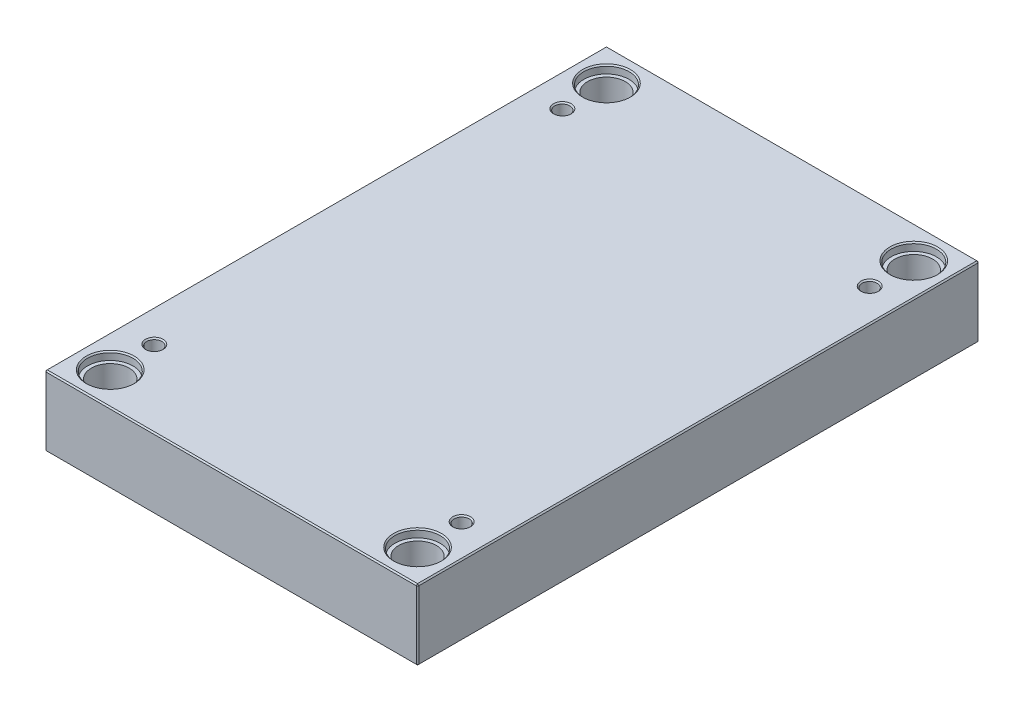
ISO-10303-21;
HEADER;
FILE_DESCRIPTION(('STEP AP214'),'2;1');
FILE_NAME('part.step','',(''),(''),'','','');
FILE_SCHEMA(('AUTOMOTIVE_DESIGN { 1 0 10303 214 1 1 1 1 }'));
ENDSEC;
DATA;
#1=APPLICATION_CONTEXT('core data for automotive mechanical design processes');
#2=APPLICATION_PROTOCOL_DEFINITION('international standard','automotive_design',2000,#1);
#3=PRODUCT_CONTEXT('',#1,'mechanical');
#4=PRODUCT('Part','Part','',(#3));
#5=PRODUCT_RELATED_PRODUCT_CATEGORY('part','',(#4));
#6=PRODUCT_DEFINITION_FORMATION('','',#4);
#7=PRODUCT_DEFINITION_CONTEXT('part definition',#1,'design');
#8=PRODUCT_DEFINITION('design','',#6,#7);
#9=PRODUCT_DEFINITION_SHAPE('','',#8);
#10=(LENGTH_UNIT() NAMED_UNIT(*) SI_UNIT(.MILLI.,.METRE.));
#11=(NAMED_UNIT(*) PLANE_ANGLE_UNIT() SI_UNIT($,.RADIAN.));
#12=(NAMED_UNIT(*) SI_UNIT($,.STERADIAN.) SOLID_ANGLE_UNIT());
#13=UNCERTAINTY_MEASURE_WITH_UNIT(LENGTH_MEASURE(1.E-05),#10,'distance_accuracy_value','');
#14=(GEOMETRIC_REPRESENTATION_CONTEXT(3) GLOBAL_UNCERTAINTY_ASSIGNED_CONTEXT((#13)) GLOBAL_UNIT_ASSIGNED_CONTEXT((#10,
#11,#12)) REPRESENTATION_CONTEXT('',''));
#15=CARTESIAN_POINT('',(0.,0.,0.));
#16=DIRECTION('',(0.,0.,1.));
#17=DIRECTION('',(1.,0.,0.));
#18=AXIS2_PLACEMENT_3D('',#15,#16,#17);
#19=CARTESIAN_POINT('',(-122.,0.,-197.));
#20=DIRECTION('',(0.,1.,0.));
#21=DIRECTION('',(0.,0.,1.));
#22=AXIS2_PLACEMENT_3D('',#19,#20,#21);
#23=CYLINDRICAL_SURFACE('',#22,15.);
#24=CARTESIAN_POINT('',(-122.,0.999999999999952,-197.));
#25=DIRECTION('',(0.,1.,0.));
#26=DIRECTION('',(0.,0.,1.));
#27=AXIS2_PLACEMENT_3D('',#24,#25,#26);
#28=CIRCLE('',#27,15.);
#29=CARTESIAN_POINT('',(-122.,0.999999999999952,-182.));
#30=VERTEX_POINT('',#29);
#31=EDGE_CURVE('E472',#30,#30,#28,.F.);
#32=ORIENTED_EDGE('',*,*,#31,.T.);
#33=EDGE_LOOP('',(#32));
#34=FACE_BOUND('',#33,.T.);
#35=CARTESIAN_POINT('',(-122.,49.7,-197.));
#36=DIRECTION('',(0.,1.,0.));
#37=DIRECTION('',(0.,0.,1.));
#38=AXIS2_PLACEMENT_3D('',#35,#36,#37);
#39=CIRCLE('',#38,15.);
#40=CARTESIAN_POINT('',(-122.,49.7,-182.));
#41=VERTEX_POINT('',#40);
#42=EDGE_CURVE('E221',#41,#41,#39,.F.);
#43=ORIENTED_EDGE('',*,*,#42,.F.);
#44=EDGE_LOOP('',(#43));
#45=FACE_BOUND('',#44,.T.);
#46=ADVANCED_FACE('F16',(#34,#45),#23,.F.);
#47=CARTESIAN_POINT('',(122.,0.,-197.));
#48=DIRECTION('',(0.,1.,0.));
#49=DIRECTION('',(0.,0.,1.));
#50=AXIS2_PLACEMENT_3D('',#47,#48,#49);
#51=CYLINDRICAL_SURFACE('',#50,15.);
#52=CARTESIAN_POINT('',(122.,0.999999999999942,-197.));
#53=DIRECTION('',(0.,1.,0.));
#54=DIRECTION('',(0.,0.,1.));
#55=AXIS2_PLACEMENT_3D('',#52,#53,#54);
#56=CIRCLE('',#55,15.);
#57=CARTESIAN_POINT('',(122.,0.999999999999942,-182.));
#58=VERTEX_POINT('',#57);
#59=EDGE_CURVE('E474',#58,#58,#56,.F.);
#60=ORIENTED_EDGE('',*,*,#59,.T.);
#61=EDGE_LOOP('',(#60));
#62=FACE_BOUND('',#61,.T.);
#63=CARTESIAN_POINT('',(122.,49.7,-197.));
#64=DIRECTION('',(0.,1.,0.));
#65=DIRECTION('',(0.,0.,1.));
#66=AXIS2_PLACEMENT_3D('',#63,#64,#65);
#67=CIRCLE('',#66,15.);
#68=CARTESIAN_POINT('',(122.,49.7,-182.));
#69=VERTEX_POINT('',#68);
#70=EDGE_CURVE('E218',#69,#69,#67,.F.);
#71=ORIENTED_EDGE('',*,*,#70,.F.);
#72=EDGE_LOOP('',(#71));
#73=FACE_BOUND('',#72,.T.);
#74=ADVANCED_FACE('F263',(#62,#73),#51,.F.);
#75=CARTESIAN_POINT('',(122.,0.,197.));
#76=DIRECTION('',(0.,1.,0.));
#77=DIRECTION('',(0.,0.,1.));
#78=AXIS2_PLACEMENT_3D('',#75,#76,#77);
#79=CYLINDRICAL_SURFACE('',#78,15.);
#80=CARTESIAN_POINT('',(122.,0.999999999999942,197.));
#81=DIRECTION('',(0.,1.,0.));
#82=DIRECTION('',(0.,0.,1.));
#83=AXIS2_PLACEMENT_3D('',#80,#81,#82);
#84=CIRCLE('',#83,15.);
#85=CARTESIAN_POINT('',(122.,0.999999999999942,212.));
#86=VERTEX_POINT('',#85);
#87=EDGE_CURVE('E477',#86,#86,#84,.F.);
#88=ORIENTED_EDGE('',*,*,#87,.T.);
#89=EDGE_LOOP('',(#88));
#90=FACE_BOUND('',#89,.T.);
#91=CARTESIAN_POINT('',(122.,49.7,197.));
#92=DIRECTION('',(0.,1.,0.));
#93=DIRECTION('',(0.,0.,1.));
#94=AXIS2_PLACEMENT_3D('',#91,#92,#93);
#95=CIRCLE('',#94,15.);
#96=CARTESIAN_POINT('',(122.,49.7,212.));
#97=VERTEX_POINT('',#96);
#98=EDGE_CURVE('E214',#97,#97,#95,.F.);
#99=ORIENTED_EDGE('',*,*,#98,.F.);
#100=EDGE_LOOP('',(#99));
#101=FACE_BOUND('',#100,.T.);
#102=ADVANCED_FACE('F270',(#90,#101),#79,.F.);
#103=CARTESIAN_POINT('',(-122.,0.,197.));
#104=DIRECTION('',(0.,1.,0.));
#105=DIRECTION('',(0.,0.,1.));
#106=AXIS2_PLACEMENT_3D('',#103,#104,#105);
#107=CYLINDRICAL_SURFACE('',#106,15.);
#108=CARTESIAN_POINT('',(-122.,0.999999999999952,197.));
#109=DIRECTION('',(0.,1.,0.));
#110=DIRECTION('',(0.,0.,1.));
#111=AXIS2_PLACEMENT_3D('',#108,#109,#110);
#112=CIRCLE('',#111,15.);
#113=CARTESIAN_POINT('',(-122.,0.999999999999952,212.));
#114=VERTEX_POINT('',#113);
#115=EDGE_CURVE('E480',#114,#114,#112,.F.);
#116=ORIENTED_EDGE('',*,*,#115,.T.);
#117=EDGE_LOOP('',(#116));
#118=FACE_BOUND('',#117,.T.);
#119=CARTESIAN_POINT('',(-122.,49.7,197.));
#120=DIRECTION('',(0.,1.,0.));
#121=DIRECTION('',(0.,0.,1.));
#122=AXIS2_PLACEMENT_3D('',#119,#120,#121);
#123=CIRCLE('',#122,15.);
#124=CARTESIAN_POINT('',(-122.,49.7,212.));
#125=VERTEX_POINT('',#124);
#126=EDGE_CURVE('E211',#125,#125,#123,.F.);
#127=ORIENTED_EDGE('',*,*,#126,.F.);
#128=EDGE_LOOP('',(#127));
#129=FACE_BOUND('',#128,.T.);
#130=ADVANCED_FACE('F277',(#118,#129),#107,.F.);
#131=CARTESIAN_POINT('',(-148.,56.,223.));
#132=DIRECTION('',(1.,0.,0.));
#133=DIRECTION('',(0.,0.,-1.));
#134=AXIS2_PLACEMENT_3D('',#131,#132,#133);
#135=PLANE('',#134);
#136=DIRECTION('',(0.,-1.,0.));
#137=VECTOR('',#136,1.);
#138=CARTESIAN_POINT('',(-148.,56.,-222.));
#139=LINE('',#138,#137);
#140=CARTESIAN_POINT('',(-148.,55.,-222.));
#141=VERTEX_POINT('',#140);
#142=CARTESIAN_POINT('',(-148.,0.999999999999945,-222.));
#143=VERTEX_POINT('',#142);
#144=EDGE_CURVE('E487',#141,#143,#139,.T.);
#145=ORIENTED_EDGE('',*,*,#144,.T.);
#146=DIRECTION('',(0.,0.,1.));
#147=VECTOR('',#146,1.);
#148=CARTESIAN_POINT('',(-148.,0.999999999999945,223.));
#149=LINE('',#148,#147);
#150=CARTESIAN_POINT('',(-148.,0.999999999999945,222.));
#151=VERTEX_POINT('',#150);
#152=EDGE_CURVE('E490',#143,#151,#149,.T.);
#153=ORIENTED_EDGE('',*,*,#152,.T.);
#154=DIRECTION('',(0.,1.,0.));
#155=VECTOR('',#154,1.);
#156=CARTESIAN_POINT('',(-148.,56.,222.));
#157=LINE('',#156,#155);
#158=CARTESIAN_POINT('',(-148.,55.,222.));
#159=VERTEX_POINT('',#158);
#160=EDGE_CURVE('E485',#151,#159,#157,.T.);
#161=ORIENTED_EDGE('',*,*,#160,.T.);
#162=DIRECTION('',(0.,0.,-1.));
#163=VECTOR('',#162,1.);
#164=CARTESIAN_POINT('',(-148.,55.,-223.));
#165=LINE('',#164,#163);
#166=EDGE_CURVE('E483',#159,#141,#165,.T.);
#167=ORIENTED_EDGE('',*,*,#166,.T.);
#168=EDGE_LOOP('',(#145,#153,#161,#167));
#169=FACE_BOUND('',#168,.T.);
#170=ADVANCED_FACE('F298',(#169),#135,.F.);
#171=CARTESIAN_POINT('',(148.,56.,223.));
#172=DIRECTION('',(0.,0.,-1.));
#173=DIRECTION('',(-1.,0.,0.));
#174=AXIS2_PLACEMENT_3D('',#171,#172,#173);
#175=PLANE('',#174);
#176=DIRECTION('',(-1.,0.,0.));
#177=VECTOR('',#176,1.);
#178=CARTESIAN_POINT('',(-148.,55.,223.));
#179=LINE('',#178,#177);
#180=CARTESIAN_POINT('',(147.,55.,223.));
#181=VERTEX_POINT('',#180);
#182=CARTESIAN_POINT('',(-147.,55.,223.));
#183=VERTEX_POINT('',#182);
#184=EDGE_CURVE('E509',#181,#183,#179,.T.);
#185=ORIENTED_EDGE('',*,*,#184,.T.);
#186=DIRECTION('',(0.,-1.,0.));
#187=VECTOR('',#186,1.);
#188=CARTESIAN_POINT('',(-147.,56.,223.));
#189=LINE('',#188,#187);
#190=CARTESIAN_POINT('',(-147.,0.999999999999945,223.));
#191=VERTEX_POINT('',#190);
#192=EDGE_CURVE('E515',#183,#191,#189,.T.);
#193=ORIENTED_EDGE('',*,*,#192,.T.);
#194=DIRECTION('',(1.,0.,0.));
#195=VECTOR('',#194,1.);
#196=CARTESIAN_POINT('',(148.,0.999999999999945,223.));
#197=LINE('',#196,#195);
#198=CARTESIAN_POINT('',(147.,0.999999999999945,223.));
#199=VERTEX_POINT('',#198);
#200=EDGE_CURVE('E513',#191,#199,#197,.T.);
#201=ORIENTED_EDGE('',*,*,#200,.T.);
#202=DIRECTION('',(0.,1.,0.));
#203=VECTOR('',#202,1.);
#204=CARTESIAN_POINT('',(147.,56.,223.));
#205=LINE('',#204,#203);
#206=EDGE_CURVE('E511',#199,#181,#205,.T.);
#207=ORIENTED_EDGE('',*,*,#206,.T.);
#208=EDGE_LOOP('',(#185,#193,#201,#207));
#209=FACE_BOUND('',#208,.T.);
#210=ADVANCED_FACE('F294',(#209),#175,.F.);
#211=CARTESIAN_POINT('',(148.,56.,223.));
#212=DIRECTION('',(-1.,0.,0.));
#213=DIRECTION('',(0.,0.,1.));
#214=AXIS2_PLACEMENT_3D('',#211,#212,#213);
#215=PLANE('',#214);
#216=DIRECTION('',(0.,0.,-1.));
#217=VECTOR('',#216,1.);
#218=CARTESIAN_POINT('',(148.,0.999999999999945,223.));
#219=LINE('',#218,#217);
#220=CARTESIAN_POINT('',(148.,0.999999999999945,222.));
#221=VERTEX_POINT('',#220);
#222=CARTESIAN_POINT('',(148.,0.999999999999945,-222.));
#223=VERTEX_POINT('',#222);
#224=EDGE_CURVE('E504',#221,#223,#219,.T.);
#225=ORIENTED_EDGE('',*,*,#224,.T.);
#226=DIRECTION('',(0.,1.,0.));
#227=VECTOR('',#226,1.);
#228=CARTESIAN_POINT('',(148.,56.,-222.));
#229=LINE('',#228,#227);
#230=CARTESIAN_POINT('',(148.,55.,-222.));
#231=VERTEX_POINT('',#230);
#232=EDGE_CURVE('E506',#223,#231,#229,.T.);
#233=ORIENTED_EDGE('',*,*,#232,.T.);
#234=DIRECTION('',(0.,0.,1.));
#235=VECTOR('',#234,1.);
#236=CARTESIAN_POINT('',(148.,55.,223.));
#237=LINE('',#236,#235);
#238=CARTESIAN_POINT('',(148.,55.,222.));
#239=VERTEX_POINT('',#238);
#240=EDGE_CURVE('E500',#231,#239,#237,.T.);
#241=ORIENTED_EDGE('',*,*,#240,.T.);
#242=DIRECTION('',(0.,-1.,0.));
#243=VECTOR('',#242,1.);
#244=CARTESIAN_POINT('',(148.,56.,222.));
#245=LINE('',#244,#243);
#246=EDGE_CURVE('E502',#239,#221,#245,.T.);
#247=ORIENTED_EDGE('',*,*,#246,.T.);
#248=EDGE_LOOP('',(#225,#233,#241,#247));
#249=FACE_BOUND('',#248,.T.);
#250=ADVANCED_FACE('F290',(#249),#215,.F.);
#251=CARTESIAN_POINT('',(148.,56.,-223.));
#252=DIRECTION('',(0.,0.,1.));
#253=DIRECTION('',(1.,0.,0.));
#254=AXIS2_PLACEMENT_3D('',#251,#252,#253);
#255=PLANE('',#254);
#256=DIRECTION('',(0.,-1.,0.));
#257=VECTOR('',#256,1.);
#258=CARTESIAN_POINT('',(147.,56.,-223.));
#259=LINE('',#258,#257);
#260=CARTESIAN_POINT('',(147.,55.,-223.));
#261=VERTEX_POINT('',#260);
#262=CARTESIAN_POINT('',(147.,0.999999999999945,-223.));
#263=VERTEX_POINT('',#262);
#264=EDGE_CURVE('E494',#261,#263,#259,.T.);
#265=ORIENTED_EDGE('',*,*,#264,.T.);
#266=DIRECTION('',(-1.,0.,0.));
#267=VECTOR('',#266,1.);
#268=CARTESIAN_POINT('',(148.,0.999999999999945,-223.));
#269=LINE('',#268,#267);
#270=CARTESIAN_POINT('',(-147.,0.999999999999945,-223.));
#271=VERTEX_POINT('',#270);
#272=EDGE_CURVE('E138',#263,#271,#269,.T.);
#273=ORIENTED_EDGE('',*,*,#272,.T.);
#274=DIRECTION('',(0.,1.,0.));
#275=VECTOR('',#274,1.);
#276=CARTESIAN_POINT('',(-147.,56.,-223.));
#277=LINE('',#276,#275);
#278=CARTESIAN_POINT('',(-147.,55.,-223.));
#279=VERTEX_POINT('',#278);
#280=EDGE_CURVE('E496',#271,#279,#277,.T.);
#281=ORIENTED_EDGE('',*,*,#280,.T.);
#282=DIRECTION('',(1.,0.,0.));
#283=VECTOR('',#282,1.);
#284=CARTESIAN_POINT('',(148.,55.,-223.));
#285=LINE('',#284,#283);
#286=EDGE_CURVE('E492',#279,#261,#285,.T.);
#287=ORIENTED_EDGE('',*,*,#286,.T.);
#288=EDGE_LOOP('',(#265,#273,#281,#287));
#289=FACE_BOUND('',#288,.T.);
#290=ADVANCED_FACE('F282',(#289),#255,.F.);
#291=CARTESIAN_POINT('',(0.,56.,0.));
#292=DIRECTION('',(0.,1.,0.));
#293=DIRECTION('',(0.,0.,1.));
#294=AXIS2_PLACEMENT_3D('',#291,#292,#293);
#295=PLANE('',#294);
#296=CARTESIAN_POINT('',(122.,56.,197.));
#297=DIRECTION('',(0.,1.,0.));
#298=DIRECTION('',(0.,0.,1.));
#299=AXIS2_PLACEMENT_3D('',#296,#297,#298);
#300=CIRCLE('',#299,19.);
#301=CARTESIAN_POINT('',(122.,56.,216.));
#302=VERTEX_POINT('',#301);
#303=EDGE_CURVE('E236',#302,#302,#300,.F.);
#304=ORIENTED_EDGE('',*,*,#303,.T.);
#305=EDGE_LOOP('',(#304));
#306=FACE_BOUND('',#305,.T.);
#307=CARTESIAN_POINT('',(-122.,56.,197.));
#308=DIRECTION('',(0.,1.,0.));
#309=DIRECTION('',(0.,0.,1.));
#310=AXIS2_PLACEMENT_3D('',#307,#308,#309);
#311=CIRCLE('',#310,19.);
#312=CARTESIAN_POINT('',(-122.,56.,216.));
#313=VERTEX_POINT('',#312);
#314=EDGE_CURVE('E233',#313,#313,#311,.F.);
#315=ORIENTED_EDGE('',*,*,#314,.T.);
#316=EDGE_LOOP('',(#315));
#317=FACE_BOUND('',#316,.T.);
#318=CARTESIAN_POINT('',(122.,56.,-197.));
#319=DIRECTION('',(0.,1.,0.));
#320=DIRECTION('',(0.,0.,1.));
#321=AXIS2_PLACEMENT_3D('',#318,#319,#320);
#322=CIRCLE('',#321,19.);
#323=CARTESIAN_POINT('',(122.,56.,-178.));
#324=VERTEX_POINT('',#323);
#325=EDGE_CURVE('E230',#324,#324,#322,.F.);
#326=ORIENTED_EDGE('',*,*,#325,.T.);
#327=EDGE_LOOP('',(#326));
#328=FACE_BOUND('',#327,.T.);
#329=CARTESIAN_POINT('',(-122.,56.,-197.));
#330=DIRECTION('',(0.,1.,0.));
#331=DIRECTION('',(0.,0.,1.));
#332=AXIS2_PLACEMENT_3D('',#329,#330,#331);
#333=CIRCLE('',#332,19.);
#334=CARTESIAN_POINT('',(-122.,56.,-178.));
#335=VERTEX_POINT('',#334);
#336=EDGE_CURVE('E227',#335,#335,#333,.F.);
#337=ORIENTED_EDGE('',*,*,#336,.T.);
#338=EDGE_LOOP('',(#337));
#339=FACE_BOUND('',#338,.T.);
#340=CARTESIAN_POINT('',(-122.,56.,162.));
#341=DIRECTION('',(0.,1.,0.));
#342=DIRECTION('',(0.,0.,1.));
#343=AXIS2_PLACEMENT_3D('',#340,#341,#342);
#344=CIRCLE('',#343,7.);
#345=CARTESIAN_POINT('',(-122.,56.,169.));
#346=VERTEX_POINT('',#345);
#347=EDGE_CURVE('E198',#346,#346,#344,.F.);
#348=ORIENTED_EDGE('',*,*,#347,.T.);
#349=EDGE_LOOP('',(#348));
#350=FACE_BOUND('',#349,.T.);
#351=CARTESIAN_POINT('',(122.,56.,162.));
#352=DIRECTION('',(0.,1.,0.));
#353=DIRECTION('',(0.,0.,1.));
#354=AXIS2_PLACEMENT_3D('',#351,#352,#353);
#355=CIRCLE('',#354,7.00000000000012);
#356=CARTESIAN_POINT('',(122.,56.,169.));
#357=VERTEX_POINT('',#356);
#358=EDGE_CURVE('E195',#357,#357,#355,.F.);
#359=ORIENTED_EDGE('',*,*,#358,.T.);
#360=EDGE_LOOP('',(#359));
#361=FACE_BOUND('',#360,.T.);
#362=CARTESIAN_POINT('',(122.,56.,-162.));
#363=DIRECTION('',(0.,1.,0.));
#364=DIRECTION('',(0.,0.,1.));
#365=AXIS2_PLACEMENT_3D('',#362,#363,#364);
#366=CIRCLE('',#365,7.00000000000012);
#367=CARTESIAN_POINT('',(122.,56.,-155.));
#368=VERTEX_POINT('',#367);
#369=EDGE_CURVE('E192',#368,#368,#366,.F.);
#370=ORIENTED_EDGE('',*,*,#369,.T.);
#371=EDGE_LOOP('',(#370));
#372=FACE_BOUND('',#371,.T.);
#373=CARTESIAN_POINT('',(-122.,56.,-162.));
#374=DIRECTION('',(0.,1.,0.));
#375=DIRECTION('',(0.,0.,1.));
#376=AXIS2_PLACEMENT_3D('',#373,#374,#375);
#377=CIRCLE('',#376,7.);
#378=CARTESIAN_POINT('',(-122.,56.,-155.));
#379=VERTEX_POINT('',#378);
#380=EDGE_CURVE('E188',#379,#379,#377,.F.);
#381=ORIENTED_EDGE('',*,*,#380,.T.);
#382=EDGE_LOOP('',(#381));
#383=FACE_BOUND('',#382,.T.);
#384=DIRECTION('',(0.,0.,-1.));
#385=VECTOR('',#384,1.);
#386=CARTESIAN_POINT('',(147.,56.,-223.));
#387=LINE('',#386,#385);
#388=CARTESIAN_POINT('',(147.,56.,222.));
#389=VERTEX_POINT('',#388);
#390=CARTESIAN_POINT('',(147.,56.,-222.));
#391=VERTEX_POINT('',#390);
#392=EDGE_CURVE('E31',#389,#391,#387,.T.);
#393=ORIENTED_EDGE('',*,*,#392,.T.);
#394=DIRECTION('',(-1.,0.,0.));
#395=VECTOR('',#394,1.);
#396=CARTESIAN_POINT('',(-148.,56.,-222.));
#397=LINE('',#396,#395);
#398=CARTESIAN_POINT('',(-147.,56.,-222.));
#399=VERTEX_POINT('',#398);
#400=EDGE_CURVE('E189',#391,#399,#397,.T.);
#401=ORIENTED_EDGE('',*,*,#400,.T.);
#402=DIRECTION('',(0.,0.,1.));
#403=VECTOR('',#402,1.);
#404=CARTESIAN_POINT('',(-147.,56.,223.));
#405=LINE('',#404,#403);
#406=CARTESIAN_POINT('',(-147.,56.,222.));
#407=VERTEX_POINT('',#406);
#408=EDGE_CURVE('E518',#399,#407,#405,.T.);
#409=ORIENTED_EDGE('',*,*,#408,.T.);
#410=DIRECTION('',(1.,0.,0.));
#411=VECTOR('',#410,1.);
#412=CARTESIAN_POINT('',(148.,56.,222.));
#413=LINE('',#412,#411);
#414=EDGE_CURVE('E36',#407,#389,#413,.T.);
#415=ORIENTED_EDGE('',*,*,#414,.T.);
#416=EDGE_LOOP('',(#393,#401,#409,#415));
#417=FACE_BOUND('',#416,.T.);
#418=ADVANCED_FACE('F279',(#306,#317,#328,#339,#350,#361,#372,#383,#417),#295,.T.);
#419=CARTESIAN_POINT('',(0.,0.,0.));
#420=DIRECTION('',(0.,1.,0.));
#421=DIRECTION('',(0.,0.,1.));
#422=AXIS2_PLACEMENT_3D('',#419,#420,#421);
#423=PLANE('',#422);
#424=CARTESIAN_POINT('',(-122.,0.,-197.));
#425=DIRECTION('',(0.,1.,0.));
#426=DIRECTION('',(0.,0.,1.));
#427=AXIS2_PLACEMENT_3D('',#424,#425,#426);
#428=CIRCLE('',#427,16.);
#429=CARTESIAN_POINT('',(-122.,0.,-181.));
#430=VERTEX_POINT('',#429);
#431=EDGE_CURVE('E469',#430,#430,#428,.T.);
#432=ORIENTED_EDGE('',*,*,#431,.T.);
#433=EDGE_LOOP('',(#432));
#434=FACE_BOUND('',#433,.T.);
#435=CARTESIAN_POINT('',(122.,0.,-197.));
#436=DIRECTION('',(0.,1.,0.));
#437=DIRECTION('',(0.,0.,1.));
#438=AXIS2_PLACEMENT_3D('',#435,#436,#437);
#439=CIRCLE('',#438,16.);
#440=CARTESIAN_POINT('',(122.,0.,-181.));
#441=VERTEX_POINT('',#440);
#442=EDGE_CURVE('E466',#441,#441,#439,.T.);
#443=ORIENTED_EDGE('',*,*,#442,.T.);
#444=EDGE_LOOP('',(#443));
#445=FACE_BOUND('',#444,.T.);
#446=CARTESIAN_POINT('',(122.,0.,197.));
#447=DIRECTION('',(0.,1.,0.));
#448=DIRECTION('',(0.,0.,1.));
#449=AXIS2_PLACEMENT_3D('',#446,#447,#448);
#450=CIRCLE('',#449,16.);
#451=CARTESIAN_POINT('',(122.,0.,213.));
#452=VERTEX_POINT('',#451);
#453=EDGE_CURVE('E463',#452,#452,#450,.T.);
#454=ORIENTED_EDGE('',*,*,#453,.T.);
#455=EDGE_LOOP('',(#454));
#456=FACE_BOUND('',#455,.T.);
#457=CARTESIAN_POINT('',(-122.,0.,197.));
#458=DIRECTION('',(0.,1.,0.));
#459=DIRECTION('',(0.,0.,1.));
#460=AXIS2_PLACEMENT_3D('',#457,#458,#459);
#461=CIRCLE('',#460,16.);
#462=CARTESIAN_POINT('',(-122.,0.,213.));
#463=VERTEX_POINT('',#462);
#464=EDGE_CURVE('E460',#463,#463,#461,.T.);
#465=ORIENTED_EDGE('',*,*,#464,.T.);
#466=EDGE_LOOP('',(#465));
#467=FACE_BOUND('',#466,.T.);
#468=DIRECTION('',(0.,0.,1.));
#469=VECTOR('',#468,1.);
#470=CARTESIAN_POINT('',(147.,0.,0.));
#471=LINE('',#470,#469);
#472=CARTESIAN_POINT('',(147.,0.,-222.));
#473=VERTEX_POINT('',#472);
#474=CARTESIAN_POINT('',(147.,0.,222.));
#475=VERTEX_POINT('',#474);
#476=EDGE_CURVE('E108',#473,#475,#471,.T.);
#477=ORIENTED_EDGE('',*,*,#476,.T.);
#478=DIRECTION('',(-1.,0.,0.));
#479=VECTOR('',#478,1.);
#480=CARTESIAN_POINT('',(0.,0.,222.));
#481=LINE('',#480,#479);
#482=CARTESIAN_POINT('',(-147.,0.,222.));
#483=VERTEX_POINT('',#482);
#484=EDGE_CURVE('E458',#475,#483,#481,.T.);
#485=ORIENTED_EDGE('',*,*,#484,.T.);
#486=DIRECTION('',(0.,0.,-1.));
#487=VECTOR('',#486,1.);
#488=CARTESIAN_POINT('',(-147.,0.,0.));
#489=LINE('',#488,#487);
#490=CARTESIAN_POINT('',(-147.,0.,-222.));
#491=VERTEX_POINT('',#490);
#492=EDGE_CURVE('E110',#483,#491,#489,.T.);
#493=ORIENTED_EDGE('',*,*,#492,.T.);
#494=DIRECTION('',(1.,0.,0.));
#495=VECTOR('',#494,1.);
#496=CARTESIAN_POINT('',(0.,0.,-222.));
#497=LINE('',#496,#495);
#498=EDGE_CURVE('E104',#491,#473,#497,.T.);
#499=ORIENTED_EDGE('',*,*,#498,.T.);
#500=EDGE_LOOP('',(#477,#485,#493,#499));
#501=FACE_BOUND('',#500,.T.);
#502=ADVANCED_FACE('F106',(#434,#445,#456,#467,#501),#423,.F.);
#503=CARTESIAN_POINT('',(-122.,0.,-197.));
#504=DIRECTION('',(0.,-1.,0.));
#505=DIRECTION('',(0.,0.,-1.));
#506=AXIS2_PLACEMENT_3D('',#503,#504,#505);
#507=CONICAL_SURFACE('',#506,16.,0.78539816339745);
#508=ORIENTED_EDGE('',*,*,#31,.F.);
#509=EDGE_LOOP('',(#508));
#510=FACE_BOUND('',#509,.T.);
#511=ORIENTED_EDGE('',*,*,#431,.F.);
#512=EDGE_LOOP('',(#511));
#513=FACE_BOUND('',#512,.T.);
#514=ADVANCED_FACE('F286',(#510,#513),#507,.F.);
#515=CARTESIAN_POINT('',(122.,0.,-197.));
#516=DIRECTION('',(0.,-1.,0.));
#517=DIRECTION('',(0.,0.,-1.));
#518=AXIS2_PLACEMENT_3D('',#515,#516,#517);
#519=CONICAL_SURFACE('',#518,16.,0.785398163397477);
#520=ORIENTED_EDGE('',*,*,#59,.F.);
#521=EDGE_LOOP('',(#520));
#522=FACE_BOUND('',#521,.T.);
#523=ORIENTED_EDGE('',*,*,#442,.F.);
#524=EDGE_LOOP('',(#523));
#525=FACE_BOUND('',#524,.T.);
#526=ADVANCED_FACE('F305',(#522,#525),#519,.F.);
#527=CARTESIAN_POINT('',(122.,0.,197.));
#528=DIRECTION('',(0.,-1.,0.));
#529=DIRECTION('',(0.,0.,-1.));
#530=AXIS2_PLACEMENT_3D('',#527,#528,#529);
#531=CONICAL_SURFACE('',#530,16.,0.785398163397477);
#532=ORIENTED_EDGE('',*,*,#87,.F.);
#533=EDGE_LOOP('',(#532));
#534=FACE_BOUND('',#533,.T.);
#535=ORIENTED_EDGE('',*,*,#453,.F.);
#536=EDGE_LOOP('',(#535));
#537=FACE_BOUND('',#536,.T.);
#538=ADVANCED_FACE('F309',(#534,#537),#531,.F.);
#539=CARTESIAN_POINT('',(-122.,0.,197.));
#540=DIRECTION('',(0.,-1.,0.));
#541=DIRECTION('',(0.,0.,-1.));
#542=AXIS2_PLACEMENT_3D('',#539,#540,#541);
#543=CONICAL_SURFACE('',#542,16.,0.78539816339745);
#544=ORIENTED_EDGE('',*,*,#115,.F.);
#545=EDGE_LOOP('',(#544));
#546=FACE_BOUND('',#545,.T.);
#547=ORIENTED_EDGE('',*,*,#464,.F.);
#548=EDGE_LOOP('',(#547));
#549=FACE_BOUND('',#548,.T.);
#550=ADVANCED_FACE('F313',(#546,#549),#543,.F.);
#551=CARTESIAN_POINT('',(148.,56.,222.));
#552=DIRECTION('',(-0.707106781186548,0.,-0.707106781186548));
#553=DIRECTION('',(0.,-1.,0.));
#554=AXIS2_PLACEMENT_3D('',#551,#552,#553);
#555=PLANE('',#554);
#556=DIRECTION('',(-0.707106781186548,0.,0.707106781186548));
#557=VECTOR('',#556,1.);
#558=CARTESIAN_POINT('',(147.,55.,223.));
#559=LINE('',#558,#557);
#560=EDGE_CURVE('E126',#181,#239,#559,.F.);
#561=ORIENTED_EDGE('',*,*,#560,.F.);
#562=ORIENTED_EDGE('',*,*,#206,.F.);
#563=DIRECTION('',(0.707106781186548,0.,-0.707106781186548));
#564=VECTOR('',#563,1.);
#565=CARTESIAN_POINT('',(147.,0.999999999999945,223.));
#566=LINE('',#565,#564);
#567=EDGE_CURVE('E180',#221,#199,#566,.F.);
#568=ORIENTED_EDGE('',*,*,#567,.F.);
#569=ORIENTED_EDGE('',*,*,#246,.F.);
#570=EDGE_LOOP('',(#561,#562,#568,#569));
#571=FACE_BOUND('',#570,.T.);
#572=ADVANCED_FACE('F317',(#571),#555,.F.);
#573=CARTESIAN_POINT('',(147.,55.,223.));
#574=DIRECTION('',(0.577350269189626,0.577350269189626,0.577350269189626));
#575=DIRECTION('',(0.707106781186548,0.,-0.707106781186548));
#576=AXIS2_PLACEMENT_3D('',#573,#574,#575);
#577=PLANE('',#576);
#578=DIRECTION('',(0.,-0.707106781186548,0.707106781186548));
#579=VECTOR('',#578,1.);
#580=CARTESIAN_POINT('',(147.,55.,223.));
#581=LINE('',#580,#579);
#582=EDGE_CURVE('E175',#181,#389,#581,.F.);
#583=ORIENTED_EDGE('',*,*,#582,.F.);
#584=ORIENTED_EDGE('',*,*,#560,.T.);
#585=DIRECTION('',(-0.707106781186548,0.707106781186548,0.));
#586=VECTOR('',#585,1.);
#587=CARTESIAN_POINT('',(147.5,55.5,222.));
#588=LINE('',#587,#586);
#589=EDGE_CURVE('E177',#389,#239,#588,.F.);
#590=ORIENTED_EDGE('',*,*,#589,.F.);
#591=EDGE_LOOP('',(#583,#584,#590));
#592=FACE_BOUND('',#591,.T.);
#593=ADVANCED_FACE('F385',(#592),#577,.T.);
#594=CARTESIAN_POINT('',(147.,0.999999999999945,223.));
#595=DIRECTION('',(0.577350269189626,-0.577350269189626,0.577350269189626));
#596=DIRECTION('',(0.707106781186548,0.,-0.707106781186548));
#597=AXIS2_PLACEMENT_3D('',#594,#595,#596);
#598=PLANE('',#597);
#599=DIRECTION('',(-0.707106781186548,-0.707106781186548,0.));
#600=VECTOR('',#599,1.);
#601=CARTESIAN_POINT('',(147.5,0.499999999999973,222.));
#602=LINE('',#601,#600);
#603=EDGE_CURVE('E124',#221,#475,#602,.T.);
#604=ORIENTED_EDGE('',*,*,#603,.F.);
#605=ORIENTED_EDGE('',*,*,#567,.T.);
#606=DIRECTION('',(0.,0.707106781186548,0.707106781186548));
#607=VECTOR('',#606,1.);
#608=CARTESIAN_POINT('',(147.,0.999999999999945,223.));
#609=LINE('',#608,#607);
#610=EDGE_CURVE('E172',#475,#199,#609,.T.);
#611=ORIENTED_EDGE('',*,*,#610,.F.);
#612=EDGE_LOOP('',(#604,#605,#611));
#613=FACE_BOUND('',#612,.T.);
#614=ADVANCED_FACE('F381',(#613),#598,.T.);
#615=CARTESIAN_POINT('',(147.,56.,0.));
#616=DIRECTION('',(0.707106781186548,0.707106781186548,0.));
#617=DIRECTION('',(0.,0.,1.));
#618=AXIS2_PLACEMENT_3D('',#615,#616,#617);
#619=PLANE('',#618);
#620=ORIENTED_EDGE('',*,*,#589,.T.);
#621=ORIENTED_EDGE('',*,*,#240,.F.);
#622=DIRECTION('',(0.707106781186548,-0.707106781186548,0.));
#623=VECTOR('',#622,1.);
#624=CARTESIAN_POINT('',(148.,55.,-222.));
#625=LINE('',#624,#623);
#626=EDGE_CURVE('E166',#391,#231,#625,.T.);
#627=ORIENTED_EDGE('',*,*,#626,.F.);
#628=ORIENTED_EDGE('',*,*,#392,.F.);
#629=EDGE_LOOP('',(#620,#621,#627,#628));
#630=FACE_BOUND('',#629,.T.);
#631=ADVANCED_FACE('F377',(#630),#619,.T.);
#632=CARTESIAN_POINT('',(0.,56.,222.));
#633=DIRECTION('',(0.,0.707106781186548,0.707106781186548));
#634=DIRECTION('',(-1.,0.,0.));
#635=AXIS2_PLACEMENT_3D('',#632,#633,#634);
#636=PLANE('',#635);
#637=ORIENTED_EDGE('',*,*,#582,.T.);
#638=ORIENTED_EDGE('',*,*,#414,.F.);
#639=DIRECTION('',(0.,0.707106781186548,-0.707106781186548));
#640=VECTOR('',#639,1.);
#641=CARTESIAN_POINT('',(-147.,55.5,222.5));
#642=LINE('',#641,#640);
#643=EDGE_CURVE('E163',#183,#407,#642,.T.);
#644=ORIENTED_EDGE('',*,*,#643,.F.);
#645=ORIENTED_EDGE('',*,*,#184,.F.);
#646=EDGE_LOOP('',(#637,#638,#644,#645));
#647=FACE_BOUND('',#646,.T.);
#648=ADVANCED_FACE('F373',(#647),#636,.T.);
#649=CARTESIAN_POINT('',(-147.,56.,223.));
#650=DIRECTION('',(0.707106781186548,0.,-0.707106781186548));
#651=DIRECTION('',(0.,-1.,0.));
#652=AXIS2_PLACEMENT_3D('',#649,#650,#651);
#653=PLANE('',#652);
#654=DIRECTION('',(0.707106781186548,0.,0.707106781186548));
#655=VECTOR('',#654,1.);
#656=CARTESIAN_POINT('',(-147.,0.999999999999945,223.));
#657=LINE('',#656,#655);
#658=EDGE_CURVE('E157',#191,#151,#657,.F.);
#659=ORIENTED_EDGE('',*,*,#658,.F.);
#660=ORIENTED_EDGE('',*,*,#192,.F.);
#661=DIRECTION('',(-0.707106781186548,0.,-0.707106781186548));
#662=VECTOR('',#661,1.);
#663=CARTESIAN_POINT('',(-148.,55.,222.));
#664=LINE('',#663,#662);
#665=EDGE_CURVE('E160',#159,#183,#664,.F.);
#666=ORIENTED_EDGE('',*,*,#665,.F.);
#667=ORIENTED_EDGE('',*,*,#160,.F.);
#668=EDGE_LOOP('',(#659,#660,#666,#667));
#669=FACE_BOUND('',#668,.T.);
#670=ADVANCED_FACE('F369',(#669),#653,.F.);
#671=CARTESIAN_POINT('',(148.,0.999999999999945,223.));
#672=DIRECTION('',(0.,0.707106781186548,-0.707106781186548));
#673=DIRECTION('',(1.,0.,0.));
#674=AXIS2_PLACEMENT_3D('',#671,#672,#673);
#675=PLANE('',#674);
#676=ORIENTED_EDGE('',*,*,#610,.T.);
#677=ORIENTED_EDGE('',*,*,#200,.F.);
#678=DIRECTION('',(0.,-0.707106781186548,-0.707106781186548));
#679=VECTOR('',#678,1.);
#680=CARTESIAN_POINT('',(-147.,0.999999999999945,223.));
#681=LINE('',#680,#679);
#682=EDGE_CURVE('E135',#483,#191,#681,.F.);
#683=ORIENTED_EDGE('',*,*,#682,.F.);
#684=ORIENTED_EDGE('',*,*,#484,.F.);
#685=EDGE_LOOP('',(#676,#677,#683,#684));
#686=FACE_BOUND('',#685,.T.);
#687=ADVANCED_FACE('F366',(#686),#675,.F.);
#688=CARTESIAN_POINT('',(148.,0.999999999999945,223.));
#689=DIRECTION('',(-0.707106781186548,0.707106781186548,0.));
#690=DIRECTION('',(0.,0.,-1.));
#691=AXIS2_PLACEMENT_3D('',#688,#689,#690);
#692=PLANE('',#691);
#693=ORIENTED_EDGE('',*,*,#603,.T.);
#694=ORIENTED_EDGE('',*,*,#476,.F.);
#695=DIRECTION('',(0.707106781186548,0.707106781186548,0.));
#696=VECTOR('',#695,1.);
#697=CARTESIAN_POINT('',(147.5,0.499999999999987,-222.));
#698=LINE('',#697,#696);
#699=EDGE_CURVE('E121',#223,#473,#698,.F.);
#700=ORIENTED_EDGE('',*,*,#699,.F.);
#701=ORIENTED_EDGE('',*,*,#224,.F.);
#702=EDGE_LOOP('',(#693,#694,#700,#701));
#703=FACE_BOUND('',#702,.T.);
#704=ADVANCED_FACE('F119',(#703),#692,.F.);
#705=CARTESIAN_POINT('',(147.,56.,-223.));
#706=DIRECTION('',(-0.707106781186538,0.,0.707106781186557));
#707=DIRECTION('',(0.,-1.,0.));
#708=AXIS2_PLACEMENT_3D('',#705,#706,#707);
#709=PLANE('',#708);
#710=DIRECTION('',(0.707106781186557,0.,0.707106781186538));
#711=VECTOR('',#710,1.);
#712=CARTESIAN_POINT('',(148.,55.,-222.));
#713=LINE('',#712,#711);
#714=EDGE_CURVE('E168',#231,#261,#713,.F.);
#715=ORIENTED_EDGE('',*,*,#714,.F.);
#716=ORIENTED_EDGE('',*,*,#232,.F.);
#717=DIRECTION('',(-0.707106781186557,0.,-0.707106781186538));
#718=VECTOR('',#717,1.);
#719=CARTESIAN_POINT('',(147.,0.999999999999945,-223.));
#720=LINE('',#719,#718);
#721=EDGE_CURVE('E134',#263,#223,#720,.F.);
#722=ORIENTED_EDGE('',*,*,#721,.F.);
#723=ORIENTED_EDGE('',*,*,#264,.F.);
#724=EDGE_LOOP('',(#715,#716,#722,#723));
#725=FACE_BOUND('',#724,.T.);
#726=ADVANCED_FACE('F359',(#725),#709,.F.);
#727=CARTESIAN_POINT('',(148.,55.,-222.));
#728=DIRECTION('',(0.577350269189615,0.577350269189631,-0.577350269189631));
#729=DIRECTION('',(0.,0.707106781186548,0.707106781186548));
#730=AXIS2_PLACEMENT_3D('',#727,#728,#729);
#731=PLANE('',#730);
#732=ORIENTED_EDGE('',*,*,#626,.T.);
#733=ORIENTED_EDGE('',*,*,#714,.T.);
#734=DIRECTION('',(0.,0.707106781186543,0.707106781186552));
#735=VECTOR('',#734,1.);
#736=CARTESIAN_POINT('',(147.,55.5,-222.5));
#737=LINE('',#736,#735);
#738=EDGE_CURVE('E152',#391,#261,#737,.F.);
#739=ORIENTED_EDGE('',*,*,#738,.F.);
#740=EDGE_LOOP('',(#732,#733,#739));
#741=FACE_BOUND('',#740,.T.);
#742=ADVANCED_FACE('F355',(#741),#731,.T.);
#743=CARTESIAN_POINT('',(-148.,55.,222.));
#744=DIRECTION('',(-0.577350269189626,0.577350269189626,0.577350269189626));
#745=DIRECTION('',(0.707106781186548,0.,0.707106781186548));
#746=AXIS2_PLACEMENT_3D('',#743,#744,#745);
#747=PLANE('',#746);
#748=ORIENTED_EDGE('',*,*,#665,.T.);
#749=ORIENTED_EDGE('',*,*,#643,.T.);
#750=DIRECTION('',(-0.707106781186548,-0.707106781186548,0.));
#751=VECTOR('',#750,1.);
#752=CARTESIAN_POINT('',(-148.,55.,222.));
#753=LINE('',#752,#751);
#754=EDGE_CURVE('E143',#159,#407,#753,.F.);
#755=ORIENTED_EDGE('',*,*,#754,.F.);
#756=EDGE_LOOP('',(#748,#749,#755));
#757=FACE_BOUND('',#756,.T.);
#758=ADVANCED_FACE('F351',(#757),#747,.T.);
#759=CARTESIAN_POINT('',(-147.,0.999999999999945,223.));
#760=DIRECTION('',(-0.577350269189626,-0.577350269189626,0.577350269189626));
#761=DIRECTION('',(0.707106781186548,0.,0.707106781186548));
#762=AXIS2_PLACEMENT_3D('',#759,#760,#761);
#763=PLANE('',#762);
#764=ORIENTED_EDGE('',*,*,#682,.T.);
#765=ORIENTED_EDGE('',*,*,#658,.T.);
#766=DIRECTION('',(-0.707106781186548,0.707106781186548,0.));
#767=VECTOR('',#766,1.);
#768=CARTESIAN_POINT('',(-147.5,0.499999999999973,222.));
#769=LINE('',#768,#767);
#770=EDGE_CURVE('E139',#483,#151,#769,.T.);
#771=ORIENTED_EDGE('',*,*,#770,.F.);
#772=EDGE_LOOP('',(#764,#765,#771));
#773=FACE_BOUND('',#772,.T.);
#774=ADVANCED_FACE('F348',(#773),#763,.T.);
#775=CARTESIAN_POINT('',(147.,0.999999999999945,-223.));
#776=DIRECTION('',(0.577350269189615,-0.577350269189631,-0.577350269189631));
#777=DIRECTION('',(0.,0.707106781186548,-0.707106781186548));
#778=AXIS2_PLACEMENT_3D('',#775,#776,#777);
#779=PLANE('',#778);
#780=ORIENTED_EDGE('',*,*,#721,.T.);
#781=ORIENTED_EDGE('',*,*,#699,.T.);
#782=DIRECTION('',(0.,-0.707106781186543,0.707106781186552));
#783=VECTOR('',#782,1.);
#784=CARTESIAN_POINT('',(147.,0.999999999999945,-223.));
#785=LINE('',#784,#783);
#786=EDGE_CURVE('E131',#263,#473,#785,.T.);
#787=ORIENTED_EDGE('',*,*,#786,.F.);
#788=EDGE_LOOP('',(#780,#781,#787));
#789=FACE_BOUND('',#788,.T.);
#790=ADVANCED_FACE('F130',(#789),#779,.T.);
#791=CARTESIAN_POINT('',(0.,56.,-222.));
#792=DIRECTION('',(0.,0.707106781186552,-0.707106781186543));
#793=DIRECTION('',(1.,0.,0.));
#794=AXIS2_PLACEMENT_3D('',#791,#792,#793);
#795=PLANE('',#794);
#796=ORIENTED_EDGE('',*,*,#738,.T.);
#797=ORIENTED_EDGE('',*,*,#286,.F.);
#798=DIRECTION('',(0.,-0.707106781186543,-0.707106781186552));
#799=VECTOR('',#798,1.);
#800=CARTESIAN_POINT('',(-147.,55.,-223.));
#801=LINE('',#800,#799);
#802=EDGE_CURVE('E140',#399,#279,#801,.T.);
#803=ORIENTED_EDGE('',*,*,#802,.F.);
#804=ORIENTED_EDGE('',*,*,#400,.F.);
#805=EDGE_LOOP('',(#796,#797,#803,#804));
#806=FACE_BOUND('',#805,.T.);
#807=ADVANCED_FACE('F341',(#806),#795,.T.);
#808=CARTESIAN_POINT('',(-147.,56.,0.));
#809=DIRECTION('',(-0.707106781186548,0.707106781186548,0.));
#810=DIRECTION('',(0.,0.,-1.));
#811=AXIS2_PLACEMENT_3D('',#808,#809,#810);
#812=PLANE('',#811);
#813=ORIENTED_EDGE('',*,*,#754,.T.);
#814=ORIENTED_EDGE('',*,*,#408,.F.);
#815=DIRECTION('',(0.707106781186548,0.707106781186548,0.));
#816=VECTOR('',#815,1.);
#817=CARTESIAN_POINT('',(-147.5,55.5,-222.));
#818=LINE('',#817,#816);
#819=EDGE_CURVE('E146',#141,#399,#818,.T.);
#820=ORIENTED_EDGE('',*,*,#819,.F.);
#821=ORIENTED_EDGE('',*,*,#166,.F.);
#822=EDGE_LOOP('',(#813,#814,#820,#821));
#823=FACE_BOUND('',#822,.T.);
#824=ADVANCED_FACE('F337',(#823),#812,.T.);
#825=CARTESIAN_POINT('',(-148.,0.999999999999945,223.));
#826=DIRECTION('',(0.707106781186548,0.707106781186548,0.));
#827=DIRECTION('',(0.,0.,1.));
#828=AXIS2_PLACEMENT_3D('',#825,#826,#827);
#829=PLANE('',#828);
#830=ORIENTED_EDGE('',*,*,#770,.T.);
#831=ORIENTED_EDGE('',*,*,#152,.F.);
#832=DIRECTION('',(0.707106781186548,-0.707106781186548,0.));
#833=VECTOR('',#832,1.);
#834=CARTESIAN_POINT('',(-148.,0.999999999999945,-222.));
#835=LINE('',#834,#833);
#836=EDGE_CURVE('E529',#491,#143,#835,.F.);
#837=ORIENTED_EDGE('',*,*,#836,.F.);
#838=ORIENTED_EDGE('',*,*,#492,.F.);
#839=EDGE_LOOP('',(#830,#831,#837,#838));
#840=FACE_BOUND('',#839,.T.);
#841=ADVANCED_FACE('F334',(#840),#829,.F.);
#842=CARTESIAN_POINT('',(148.,0.999999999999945,-223.));
#843=DIRECTION('',(0.,0.707106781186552,0.707106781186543));
#844=DIRECTION('',(-1.,0.,0.));
#845=AXIS2_PLACEMENT_3D('',#842,#843,#844);
#846=PLANE('',#845);
#847=ORIENTED_EDGE('',*,*,#786,.T.);
#848=ORIENTED_EDGE('',*,*,#498,.F.);
#849=DIRECTION('',(0.,0.707106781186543,-0.707106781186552));
#850=VECTOR('',#849,1.);
#851=CARTESIAN_POINT('',(-147.,0.499999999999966,-222.5));
#852=LINE('',#851,#850);
#853=EDGE_CURVE('E526',#271,#491,#852,.F.);
#854=ORIENTED_EDGE('',*,*,#853,.F.);
#855=ORIENTED_EDGE('',*,*,#272,.F.);
#856=EDGE_LOOP('',(#847,#848,#854,#855));
#857=FACE_BOUND('',#856,.T.);
#858=ADVANCED_FACE('F137',(#857),#846,.F.);
#859=CARTESIAN_POINT('',(-147.,55.,-223.));
#860=DIRECTION('',(-0.577350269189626,0.577350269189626,-0.577350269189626));
#861=DIRECTION('',(-0.707106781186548,0.,0.707106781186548));
#862=AXIS2_PLACEMENT_3D('',#859,#860,#861);
#863=PLANE('',#862);
#864=ORIENTED_EDGE('',*,*,#819,.T.);
#865=ORIENTED_EDGE('',*,*,#802,.T.);
#866=DIRECTION('',(0.707106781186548,0.,-0.707106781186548));
#867=VECTOR('',#866,1.);
#868=CARTESIAN_POINT('',(-147.,55.,-223.));
#869=LINE('',#868,#867);
#870=EDGE_CURVE('E524',#141,#279,#869,.T.);
#871=ORIENTED_EDGE('',*,*,#870,.F.);
#872=EDGE_LOOP('',(#864,#865,#871));
#873=FACE_BOUND('',#872,.T.);
#874=ADVANCED_FACE('F327',(#873),#863,.T.);
#875=CARTESIAN_POINT('',(-148.,0.999999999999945,-222.));
#876=DIRECTION('',(-0.577350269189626,-0.577350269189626,-0.577350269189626));
#877=DIRECTION('',(-0.707106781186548,0.,0.707106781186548));
#878=AXIS2_PLACEMENT_3D('',#875,#876,#877);
#879=PLANE('',#878);
#880=ORIENTED_EDGE('',*,*,#853,.T.);
#881=ORIENTED_EDGE('',*,*,#836,.T.);
#882=DIRECTION('',(-0.707106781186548,0.,0.707106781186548));
#883=VECTOR('',#882,1.);
#884=CARTESIAN_POINT('',(-148.,0.999999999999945,-222.));
#885=LINE('',#884,#883);
#886=EDGE_CURVE('E455',#271,#143,#885,.T.);
#887=ORIENTED_EDGE('',*,*,#886,.F.);
#888=EDGE_LOOP('',(#880,#881,#887));
#889=FACE_BOUND('',#888,.T.);
#890=ADVANCED_FACE('F323',(#889),#879,.T.);
#891=CARTESIAN_POINT('',(-148.,56.,-222.));
#892=DIRECTION('',(0.707106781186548,0.,0.707106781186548));
#893=DIRECTION('',(0.,-1.,0.));
#894=AXIS2_PLACEMENT_3D('',#891,#892,#893);
#895=PLANE('',#894);
#896=ORIENTED_EDGE('',*,*,#870,.T.);
#897=ORIENTED_EDGE('',*,*,#280,.F.);
#898=ORIENTED_EDGE('',*,*,#886,.T.);
#899=ORIENTED_EDGE('',*,*,#144,.F.);
#900=EDGE_LOOP('',(#896,#897,#898,#899));
#901=FACE_BOUND('',#900,.T.);
#902=ADVANCED_FACE('F319',(#901),#895,.F.);
#903=CARTESIAN_POINT('',(-122.,32.,-162.));
#904=DIRECTION('',(0.,1.,0.));
#905=DIRECTION('',(0.,0.,1.));
#906=AXIS2_PLACEMENT_3D('',#903,#904,#905);
#907=CYLINDRICAL_SURFACE('',#906,6.);
#908=CARTESIAN_POINT('',(-122.,55.,-162.));
#909=DIRECTION('',(0.,1.,0.));
#910=DIRECTION('',(0.,0.,1.));
#911=AXIS2_PLACEMENT_3D('',#908,#909,#910);
#912=CIRCLE('',#911,6.);
#913=CARTESIAN_POINT('',(-122.,55.,-156.));
#914=VERTEX_POINT('',#913);
#915=EDGE_CURVE('E207',#914,#914,#912,.T.);
#916=ORIENTED_EDGE('',*,*,#915,.T.);
#917=EDGE_LOOP('',(#916));
#918=FACE_BOUND('',#917,.T.);
#919=CARTESIAN_POINT('',(-122.,32.,-162.));
#920=DIRECTION('',(0.,1.,0.));
#921=DIRECTION('',(0.,0.,1.));
#922=AXIS2_PLACEMENT_3D('',#919,#920,#921);
#923=CIRCLE('',#922,6.);
#924=CARTESIAN_POINT('',(-122.,32.,-156.));
#925=VERTEX_POINT('',#924);
#926=EDGE_CURVE('E448',#925,#925,#923,.T.);
#927=ORIENTED_EDGE('',*,*,#926,.F.);
#928=EDGE_LOOP('',(#927));
#929=FACE_BOUND('',#928,.T.);
#930=ADVANCED_FACE('F322',(#918,#929),#907,.F.);
#931=CARTESIAN_POINT('',(-122.,32.,-162.));
#932=DIRECTION('',(0.,1.,0.));
#933=DIRECTION('',(0.,0.,1.));
#934=AXIS2_PLACEMENT_3D('',#931,#932,#933);
#935=PLANE('',#934);
#936=ORIENTED_EDGE('',*,*,#926,.T.);
#937=EDGE_LOOP('',(#936));
#938=FACE_BOUND('',#937,.T.);
#939=ADVANCED_FACE('F596',(#938),#935,.T.);
#940=CARTESIAN_POINT('',(122.,32.,-162.));
#941=DIRECTION('',(0.,1.,0.));
#942=DIRECTION('',(0.,0.,1.));
#943=AXIS2_PLACEMENT_3D('',#940,#941,#942);
#944=CYLINDRICAL_SURFACE('',#943,6.);
#945=CARTESIAN_POINT('',(122.,55.,-162.));
#946=DIRECTION('',(0.,1.,0.));
#947=DIRECTION('',(0.,0.,1.));
#948=AXIS2_PLACEMENT_3D('',#945,#946,#947);
#949=CIRCLE('',#948,6.);
#950=CARTESIAN_POINT('',(122.,55.,-156.));
#951=VERTEX_POINT('',#950);
#952=EDGE_CURVE('E204',#951,#951,#949,.T.);
#953=ORIENTED_EDGE('',*,*,#952,.T.);
#954=EDGE_LOOP('',(#953));
#955=FACE_BOUND('',#954,.T.);
#956=CARTESIAN_POINT('',(122.,32.,-162.));
#957=DIRECTION('',(0.,1.,0.));
#958=DIRECTION('',(0.,0.,1.));
#959=AXIS2_PLACEMENT_3D('',#956,#957,#958);
#960=CIRCLE('',#959,6.);
#961=CARTESIAN_POINT('',(122.,32.,-156.));
#962=VERTEX_POINT('',#961);
#963=EDGE_CURVE('E445',#962,#962,#960,.T.);
#964=ORIENTED_EDGE('',*,*,#963,.F.);
#965=EDGE_LOOP('',(#964));
#966=FACE_BOUND('',#965,.T.);
#967=ADVANCED_FACE('F592',(#955,#966),#944,.F.);
#968=CARTESIAN_POINT('',(122.,32.,-162.));
#969=DIRECTION('',(0.,1.,0.));
#970=DIRECTION('',(0.,0.,1.));
#971=AXIS2_PLACEMENT_3D('',#968,#969,#970);
#972=PLANE('',#971);
#973=ORIENTED_EDGE('',*,*,#963,.T.);
#974=EDGE_LOOP('',(#973));
#975=FACE_BOUND('',#974,.T.);
#976=ADVANCED_FACE('F588',(#975),#972,.T.);
#977=CARTESIAN_POINT('',(122.,32.,162.));
#978=DIRECTION('',(0.,1.,0.));
#979=DIRECTION('',(0.,0.,1.));
#980=AXIS2_PLACEMENT_3D('',#977,#978,#979);
#981=CYLINDRICAL_SURFACE('',#980,6.);
#982=CARTESIAN_POINT('',(122.,55.,162.));
#983=DIRECTION('',(0.,1.,0.));
#984=DIRECTION('',(0.,0.,1.));
#985=AXIS2_PLACEMENT_3D('',#982,#983,#984);
#986=CIRCLE('',#985,6.);
#987=CARTESIAN_POINT('',(122.,55.,168.));
#988=VERTEX_POINT('',#987);
#989=EDGE_CURVE('E201',#988,#988,#986,.T.);
#990=ORIENTED_EDGE('',*,*,#989,.T.);
#991=EDGE_LOOP('',(#990));
#992=FACE_BOUND('',#991,.T.);
#993=CARTESIAN_POINT('',(122.,32.,162.));
#994=DIRECTION('',(0.,1.,0.));
#995=DIRECTION('',(0.,0.,1.));
#996=AXIS2_PLACEMENT_3D('',#993,#994,#995);
#997=CIRCLE('',#996,6.);
#998=CARTESIAN_POINT('',(122.,32.,168.));
#999=VERTEX_POINT('',#998);
#1000=EDGE_CURVE('E449',#999,#999,#997,.T.);
#1001=ORIENTED_EDGE('',*,*,#1000,.F.);
#1002=EDGE_LOOP('',(#1001));
#1003=FACE_BOUND('',#1002,.T.);
#1004=ADVANCED_FACE('F591',(#992,#1003),#981,.F.);
#1005=CARTESIAN_POINT('',(122.,32.,162.));
#1006=DIRECTION('',(0.,1.,0.));
#1007=DIRECTION('',(0.,0.,1.));
#1008=AXIS2_PLACEMENT_3D('',#1005,#1006,#1007);
#1009=PLANE('',#1008);
#1010=ORIENTED_EDGE('',*,*,#1000,.T.);
#1011=EDGE_LOOP('',(#1010));
#1012=FACE_BOUND('',#1011,.T.);
#1013=ADVANCED_FACE('F598',(#1012),#1009,.T.);
#1014=CARTESIAN_POINT('',(-122.,32.,162.));
#1015=DIRECTION('',(0.,1.,0.));
#1016=DIRECTION('',(0.,0.,1.));
#1017=AXIS2_PLACEMENT_3D('',#1014,#1015,#1016);
#1018=CYLINDRICAL_SURFACE('',#1017,6.);
#1019=CARTESIAN_POINT('',(-122.,55.,162.));
#1020=DIRECTION('',(0.,1.,0.));
#1021=DIRECTION('',(0.,0.,1.));
#1022=AXIS2_PLACEMENT_3D('',#1019,#1020,#1021);
#1023=CIRCLE('',#1022,6.);
#1024=CARTESIAN_POINT('',(-122.,55.,168.));
#1025=VERTEX_POINT('',#1024);
#1026=EDGE_CURVE('E185',#1025,#1025,#1023,.T.);
#1027=ORIENTED_EDGE('',*,*,#1026,.T.);
#1028=EDGE_LOOP('',(#1027));
#1029=FACE_BOUND('',#1028,.T.);
#1030=CARTESIAN_POINT('',(-122.,32.,162.));
#1031=DIRECTION('',(0.,1.,0.));
#1032=DIRECTION('',(0.,0.,1.));
#1033=AXIS2_PLACEMENT_3D('',#1030,#1031,#1032);
#1034=CIRCLE('',#1033,6.);
#1035=CARTESIAN_POINT('',(-122.,32.,168.));
#1036=VERTEX_POINT('',#1035);
#1037=EDGE_CURVE('E224',#1036,#1036,#1034,.T.);
#1038=ORIENTED_EDGE('',*,*,#1037,.F.);
#1039=EDGE_LOOP('',(#1038));
#1040=FACE_BOUND('',#1039,.T.);
#1041=ADVANCED_FACE('F601',(#1029,#1040),#1018,.F.);
#1042=CARTESIAN_POINT('',(-122.,32.,162.));
#1043=DIRECTION('',(0.,1.,0.));
#1044=DIRECTION('',(0.,0.,1.));
#1045=AXIS2_PLACEMENT_3D('',#1042,#1043,#1044);
#1046=PLANE('',#1045);
#1047=ORIENTED_EDGE('',*,*,#1037,.T.);
#1048=EDGE_LOOP('',(#1047));
#1049=FACE_BOUND('',#1048,.T.);
#1050=ADVANCED_FACE('F397',(#1049),#1046,.T.);
#1051=CARTESIAN_POINT('',(-122.,55.,162.));
#1052=DIRECTION('',(0.,1.,0.));
#1053=DIRECTION('',(0.,0.,1.));
#1054=AXIS2_PLACEMENT_3D('',#1051,#1052,#1053);
#1055=CONICAL_SURFACE('',#1054,6.,0.785398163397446);
#1056=ORIENTED_EDGE('',*,*,#347,.F.);
#1057=EDGE_LOOP('',(#1056));
#1058=FACE_BOUND('',#1057,.T.);
#1059=ORIENTED_EDGE('',*,*,#1026,.F.);
#1060=EDGE_LOOP('',(#1059));
#1061=FACE_BOUND('',#1060,.T.);
#1062=ADVANCED_FACE('F393',(#1058,#1061),#1055,.F.);
#1063=CARTESIAN_POINT('',(122.,55.,162.));
#1064=DIRECTION('',(0.,1.,0.));
#1065=DIRECTION('',(0.,0.,1.));
#1066=AXIS2_PLACEMENT_3D('',#1063,#1064,#1065);
#1067=CONICAL_SURFACE('',#1066,6.,0.785398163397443);
#1068=ORIENTED_EDGE('',*,*,#358,.F.);
#1069=EDGE_LOOP('',(#1068));
#1070=FACE_BOUND('',#1069,.T.);
#1071=ORIENTED_EDGE('',*,*,#989,.F.);
#1072=EDGE_LOOP('',(#1071));
#1073=FACE_BOUND('',#1072,.T.);
#1074=ADVANCED_FACE('F396',(#1070,#1073),#1067,.F.);
#1075=CARTESIAN_POINT('',(122.,55.,-162.));
#1076=DIRECTION('',(0.,1.,0.));
#1077=DIRECTION('',(0.,0.,1.));
#1078=AXIS2_PLACEMENT_3D('',#1075,#1076,#1077);
#1079=CONICAL_SURFACE('',#1078,6.,0.785398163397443);
#1080=ORIENTED_EDGE('',*,*,#369,.F.);
#1081=EDGE_LOOP('',(#1080));
#1082=FACE_BOUND('',#1081,.T.);
#1083=ORIENTED_EDGE('',*,*,#952,.F.);
#1084=EDGE_LOOP('',(#1083));
#1085=FACE_BOUND('',#1084,.T.);
#1086=ADVANCED_FACE('F401',(#1082,#1085),#1079,.F.);
#1087=CARTESIAN_POINT('',(-122.,55.,-162.));
#1088=DIRECTION('',(0.,1.,0.));
#1089=DIRECTION('',(0.,0.,1.));
#1090=AXIS2_PLACEMENT_3D('',#1087,#1088,#1089);
#1091=CONICAL_SURFACE('',#1090,6.,0.785398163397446);
#1092=ORIENTED_EDGE('',*,*,#380,.F.);
#1093=EDGE_LOOP('',(#1092));
#1094=FACE_BOUND('',#1093,.T.);
#1095=ORIENTED_EDGE('',*,*,#915,.F.);
#1096=EDGE_LOOP('',(#1095));
#1097=FACE_BOUND('',#1096,.T.);
#1098=ADVANCED_FACE('F405',(#1094,#1097),#1091,.F.);
#1099=CARTESIAN_POINT('',(-122.,49.7,197.));
#1100=DIRECTION('',(0.,1.,0.));
#1101=DIRECTION('',(0.,0.,1.));
#1102=AXIS2_PLACEMENT_3D('',#1099,#1100,#1101);
#1103=PLANE('',#1102);
#1104=CARTESIAN_POINT('',(-122.,49.7,197.));
#1105=DIRECTION('',(0.,1.,0.));
#1106=DIRECTION('',(0.,0.,1.));
#1107=AXIS2_PLACEMENT_3D('',#1104,#1105,#1106);
#1108=CIRCLE('',#1107,18.);
#1109=CARTESIAN_POINT('',(-122.,49.7,215.));
#1110=VERTEX_POINT('',#1109);
#1111=EDGE_CURVE('E436',#1110,#1110,#1108,.T.);
#1112=ORIENTED_EDGE('',*,*,#1111,.T.);
#1113=EDGE_LOOP('',(#1112));
#1114=FACE_BOUND('',#1113,.T.);
#1115=ORIENTED_EDGE('',*,*,#126,.T.);
#1116=EDGE_LOOP('',(#1115));
#1117=FACE_BOUND('',#1116,.T.);
#1118=ADVANCED_FACE('F409',(#1114,#1117),#1103,.T.);
#1119=CARTESIAN_POINT('',(-122.,49.7,197.));
#1120=DIRECTION('',(0.,1.,0.));
#1121=DIRECTION('',(0.,0.,1.));
#1122=AXIS2_PLACEMENT_3D('',#1119,#1120,#1121);
#1123=CYLINDRICAL_SURFACE('',#1122,18.);
#1124=CARTESIAN_POINT('',(-122.,55.,197.));
#1125=DIRECTION('',(0.,1.,0.));
#1126=DIRECTION('',(0.,0.,1.));
#1127=AXIS2_PLACEMENT_3D('',#1124,#1125,#1126);
#1128=CIRCLE('',#1127,18.);
#1129=CARTESIAN_POINT('',(-122.,55.,215.));
#1130=VERTEX_POINT('',#1129);
#1131=EDGE_CURVE('E239',#1130,#1130,#1128,.T.);
#1132=ORIENTED_EDGE('',*,*,#1131,.T.);
#1133=EDGE_LOOP('',(#1132));
#1134=FACE_BOUND('',#1133,.T.);
#1135=ORIENTED_EDGE('',*,*,#1111,.F.);
#1136=EDGE_LOOP('',(#1135));
#1137=FACE_BOUND('',#1136,.T.);
#1138=ADVANCED_FACE('F574',(#1134,#1137),#1123,.F.);
#1139=CARTESIAN_POINT('',(122.,49.7,197.));
#1140=DIRECTION('',(0.,1.,0.));
#1141=DIRECTION('',(0.,0.,1.));
#1142=AXIS2_PLACEMENT_3D('',#1139,#1140,#1141);
#1143=PLANE('',#1142);
#1144=CARTESIAN_POINT('',(122.,49.7,197.));
#1145=DIRECTION('',(0.,1.,0.));
#1146=DIRECTION('',(0.,0.,1.));
#1147=AXIS2_PLACEMENT_3D('',#1144,#1145,#1146);
#1148=CIRCLE('',#1147,18.);
#1149=CARTESIAN_POINT('',(122.,49.7,215.));
#1150=VERTEX_POINT('',#1149);
#1151=EDGE_CURVE('E433',#1150,#1150,#1148,.T.);
#1152=ORIENTED_EDGE('',*,*,#1151,.T.);
#1153=EDGE_LOOP('',(#1152));
#1154=FACE_BOUND('',#1153,.T.);
#1155=ORIENTED_EDGE('',*,*,#98,.T.);
#1156=EDGE_LOOP('',(#1155));
#1157=FACE_BOUND('',#1156,.T.);
#1158=ADVANCED_FACE('F429',(#1154,#1157),#1143,.T.);
#1159=CARTESIAN_POINT('',(122.,49.7,197.));
#1160=DIRECTION('',(0.,1.,0.));
#1161=DIRECTION('',(0.,0.,1.));
#1162=AXIS2_PLACEMENT_3D('',#1159,#1160,#1161);
#1163=CYLINDRICAL_SURFACE('',#1162,18.);
#1164=CARTESIAN_POINT('',(122.,55.,197.));
#1165=DIRECTION('',(0.,1.,0.));
#1166=DIRECTION('',(0.,0.,1.));
#1167=AXIS2_PLACEMENT_3D('',#1164,#1165,#1166);
#1168=CIRCLE('',#1167,18.);
#1169=CARTESIAN_POINT('',(122.,55.,215.));
#1170=VERTEX_POINT('',#1169);
#1171=EDGE_CURVE('E210',#1170,#1170,#1168,.T.);
#1172=ORIENTED_EDGE('',*,*,#1171,.T.);
#1173=EDGE_LOOP('',(#1172));
#1174=FACE_BOUND('',#1173,.T.);
#1175=ORIENTED_EDGE('',*,*,#1151,.F.);
#1176=EDGE_LOOP('',(#1175));
#1177=FACE_BOUND('',#1176,.T.);
#1178=ADVANCED_FACE('F425',(#1174,#1177),#1163,.F.);
#1179=CARTESIAN_POINT('',(122.,49.7,-197.));
#1180=DIRECTION('',(0.,1.,0.));
#1181=DIRECTION('',(0.,0.,1.));
#1182=AXIS2_PLACEMENT_3D('',#1179,#1180,#1181);
#1183=PLANE('',#1182);
#1184=CARTESIAN_POINT('',(122.,49.7,-197.));
#1185=DIRECTION('',(0.,1.,0.));
#1186=DIRECTION('',(0.,0.,1.));
#1187=AXIS2_PLACEMENT_3D('',#1184,#1185,#1186);
#1188=CIRCLE('',#1187,18.);
#1189=CARTESIAN_POINT('',(122.,49.7,-179.));
#1190=VERTEX_POINT('',#1189);
#1191=EDGE_CURVE('E435',#1190,#1190,#1188,.T.);
#1192=ORIENTED_EDGE('',*,*,#1191,.T.);
#1193=EDGE_LOOP('',(#1192));
#1194=FACE_BOUND('',#1193,.T.);
#1195=ORIENTED_EDGE('',*,*,#70,.T.);
#1196=EDGE_LOOP('',(#1195));
#1197=FACE_BOUND('',#1196,.T.);
#1198=ADVANCED_FACE('F428',(#1194,#1197),#1183,.T.);
#1199=CARTESIAN_POINT('',(122.,49.7,-197.));
#1200=DIRECTION('',(0.,1.,0.));
#1201=DIRECTION('',(0.,0.,1.));
#1202=AXIS2_PLACEMENT_3D('',#1199,#1200,#1201);
#1203=CYLINDRICAL_SURFACE('',#1202,18.);
#1204=CARTESIAN_POINT('',(122.,55.,-197.));
#1205=DIRECTION('',(0.,1.,0.));
#1206=DIRECTION('',(0.,0.,1.));
#1207=AXIS2_PLACEMENT_3D('',#1204,#1205,#1206);
#1208=CIRCLE('',#1207,18.);
#1209=CARTESIAN_POINT('',(122.,55.,-179.));
#1210=VERTEX_POINT('',#1209);
#1211=EDGE_CURVE('E24',#1210,#1210,#1208,.T.);
#1212=ORIENTED_EDGE('',*,*,#1211,.T.);
#1213=EDGE_LOOP('',(#1212));
#1214=FACE_BOUND('',#1213,.T.);
#1215=ORIENTED_EDGE('',*,*,#1191,.F.);
#1216=EDGE_LOOP('',(#1215));
#1217=FACE_BOUND('',#1216,.T.);
#1218=ADVANCED_FACE('F244',(#1214,#1217),#1203,.F.);
#1219=CARTESIAN_POINT('',(-122.,49.7,-197.));
#1220=DIRECTION('',(0.,1.,0.));
#1221=DIRECTION('',(0.,0.,1.));
#1222=AXIS2_PLACEMENT_3D('',#1219,#1220,#1221);
#1223=PLANE('',#1222);
#1224=CARTESIAN_POINT('',(-122.,49.7,-197.));
#1225=DIRECTION('',(0.,1.,0.));
#1226=DIRECTION('',(0.,0.,1.));
#1227=AXIS2_PLACEMENT_3D('',#1224,#1225,#1226);
#1228=CIRCLE('',#1227,18.);
#1229=CARTESIAN_POINT('',(-122.,49.7,-179.));
#1230=VERTEX_POINT('',#1229);
#1231=EDGE_CURVE('E215',#1230,#1230,#1228,.T.);
#1232=ORIENTED_EDGE('',*,*,#1231,.T.);
#1233=EDGE_LOOP('',(#1232));
#1234=FACE_BOUND('',#1233,.T.);
#1235=ORIENTED_EDGE('',*,*,#42,.T.);
#1236=EDGE_LOOP('',(#1235));
#1237=FACE_BOUND('',#1236,.T.);
#1238=ADVANCED_FACE('F418',(#1234,#1237),#1223,.T.);
#1239=CARTESIAN_POINT('',(-122.,49.7,-197.));
#1240=DIRECTION('',(0.,1.,0.));
#1241=DIRECTION('',(0.,0.,1.));
#1242=AXIS2_PLACEMENT_3D('',#1239,#1240,#1241);
#1243=CYLINDRICAL_SURFACE('',#1242,18.);
#1244=CARTESIAN_POINT('',(-122.,55.,-197.));
#1245=DIRECTION('',(0.,1.,0.));
#1246=DIRECTION('',(0.,0.,1.));
#1247=AXIS2_PLACEMENT_3D('',#1244,#1245,#1246);
#1248=CIRCLE('',#1247,18.);
#1249=CARTESIAN_POINT('',(-122.,55.,-179.));
#1250=VERTEX_POINT('',#1249);
#1251=EDGE_CURVE('E10',#1250,#1250,#1248,.T.);
#1252=ORIENTED_EDGE('',*,*,#1251,.T.);
#1253=EDGE_LOOP('',(#1252));
#1254=FACE_BOUND('',#1253,.T.);
#1255=ORIENTED_EDGE('',*,*,#1231,.F.);
#1256=EDGE_LOOP('',(#1255));
#1257=FACE_BOUND('',#1256,.T.);
#1258=ADVANCED_FACE('F412',(#1254,#1257),#1243,.F.);
#1259=CARTESIAN_POINT('',(122.,55.,197.));
#1260=DIRECTION('',(0.,1.,0.));
#1261=DIRECTION('',(0.,0.,1.));
#1262=AXIS2_PLACEMENT_3D('',#1259,#1260,#1261);
#1263=CONICAL_SURFACE('',#1262,18.,0.785398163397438);
#1264=ORIENTED_EDGE('',*,*,#303,.F.);
#1265=EDGE_LOOP('',(#1264));
#1266=FACE_BOUND('',#1265,.T.);
#1267=ORIENTED_EDGE('',*,*,#1171,.F.);
#1268=EDGE_LOOP('',(#1267));
#1269=FACE_BOUND('',#1268,.T.);
#1270=ADVANCED_FACE('F258',(#1266,#1269),#1263,.F.);
#1271=CARTESIAN_POINT('',(-122.,55.,197.));
#1272=DIRECTION('',(0.,1.,0.));
#1273=DIRECTION('',(0.,0.,1.));
#1274=AXIS2_PLACEMENT_3D('',#1271,#1272,#1273);
#1275=CONICAL_SURFACE('',#1274,18.,0.785398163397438);
#1276=ORIENTED_EDGE('',*,*,#314,.F.);
#1277=EDGE_LOOP('',(#1276));
#1278=FACE_BOUND('',#1277,.T.);
#1279=ORIENTED_EDGE('',*,*,#1131,.F.);
#1280=EDGE_LOOP('',(#1279));
#1281=FACE_BOUND('',#1280,.T.);
#1282=ADVANCED_FACE('F249',(#1278,#1281),#1275,.F.);
#1283=CARTESIAN_POINT('',(122.,55.,-197.));
#1284=DIRECTION('',(0.,1.,0.));
#1285=DIRECTION('',(0.,0.,1.));
#1286=AXIS2_PLACEMENT_3D('',#1283,#1284,#1285);
#1287=CONICAL_SURFACE('',#1286,18.,0.785398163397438);
#1288=ORIENTED_EDGE('',*,*,#325,.F.);
#1289=EDGE_LOOP('',(#1288));
#1290=FACE_BOUND('',#1289,.T.);
#1291=ORIENTED_EDGE('',*,*,#1211,.F.);
#1292=EDGE_LOOP('',(#1291));
#1293=FACE_BOUND('',#1292,.T.);
#1294=ADVANCED_FACE('F247',(#1290,#1293),#1287,.F.);
#1295=CARTESIAN_POINT('',(-122.,55.,-197.));
#1296=DIRECTION('',(0.,1.,0.));
#1297=DIRECTION('',(0.,0.,1.));
#1298=AXIS2_PLACEMENT_3D('',#1295,#1296,#1297);
#1299=CONICAL_SURFACE('',#1298,18.,0.785398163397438);
#1300=ORIENTED_EDGE('',*,*,#336,.F.);
#1301=EDGE_LOOP('',(#1300));
#1302=FACE_BOUND('',#1301,.T.);
#1303=ORIENTED_EDGE('',*,*,#1251,.F.);
#1304=EDGE_LOOP('',(#1303));
#1305=FACE_BOUND('',#1304,.T.);
#1306=ADVANCED_FACE('F18',(#1302,#1305),#1299,.F.);
#1307=CLOSED_SHELL('',(#46,#74,#102,#130,#170,#210,#250,#290,#418,#502,#514,#526,#538,#550,#572,
#593,#614,#631,#648,#670,#687,#704,#726,#742,#758,#774,#790,#807,#824,#841,#858,#874,#890,#902,
#930,#939,#967,#976,#1004,#1013,#1041,#1050,#1062,#1074,#1086,#1098,#1118,#1138,#1158,#1178,
#1198,#1218,#1238,#1258,#1270,#1282,#1294,#1306));
#1308=MANIFOLD_SOLID_BREP('B1',#1307);
#1309=ADVANCED_BREP_SHAPE_REPRESENTATION('',(#18,#1308),#14);
#1310=SHAPE_DEFINITION_REPRESENTATION(#9,#1309);
ENDSEC;
END-ISO-10303-21;
